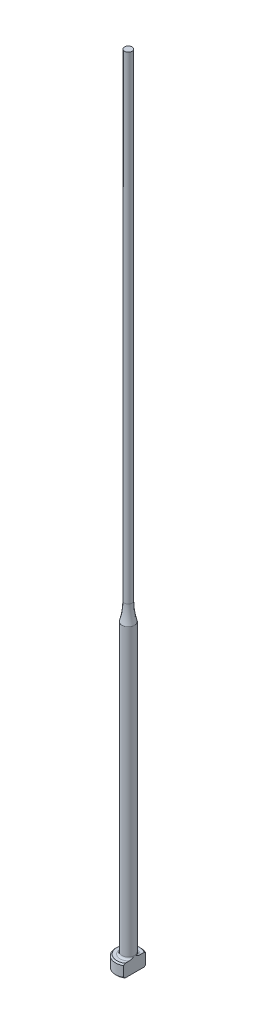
from build123d import *
from build123d.topology import SkipClean

# Parameters (mm, degrees)
CHAMFER1_SIZE = 0.2
FILLET1_R     = 0.3
KEY_DEPTH     = 126.031995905


with BuildPart() as part:
    # Sketch1 → Revolve1 (revolve)
    with BuildSketch(Plane.XY, mode=Mode.PRIVATE) as revolve1_sk:
        with BuildLine():
            Line((0, 0), (-2, 0))
            Line((-2, 0), (-2, 2))
            Line((-2, 2), (-1, 2))
            Line((-1, 2), (-1, 47.2))
            ThreePointArc((-1, 47.2), (-0.700505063, 48.585786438), (-0.6, 50))
            Line((-0.6, 50), (-0.6, 125))
            Line((-0.6, 125), (0, 125))
            Line((0, 125), (0, 0))
        make_face()
    revolve(revolve1_sk.sketch.rotate(Axis((0, 259.958771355, 0), (0, -1, 0)), 270), axis=Axis((0, 259.958771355, 0), (0, -1, 0)))

    # Chamfer1
    chamfer1_edges = [part.edges().sort_by_distance(p)[0] for p in [
        (0, 0, -2),
        (0, 2, -2),
    ]]
    chamfer(chamfer1_edges, length=CHAMFER1_SIZE)

    # Fillet1
    fillet1_edges = [part.edges().sort_by_distance(p)[0] for p in [
        (0, 2, -1),
    ]]
    fillet(fillet1_edges, radius=FILLET1_R)

    # Sketch2 → KEY (cut, through all)
    with SkipClean():  # the faces are left unmerged after this step: merging them gives an invalid solid
        with BuildSketch(Plane(origin=(0, 0, 0), x_dir=(1, 0, 0), z_dir=(0, 1, 0))):
            with BuildLine():
                Line((1, 1.732050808), (1, -1.732050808))
                ThreePointArc((1, -1.732050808), (2, 0), (1, 1.732050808))
            make_face()
        extrude(amount=KEY_DEPTH, mode=Mode.SUBTRACT)


solid = part.part
